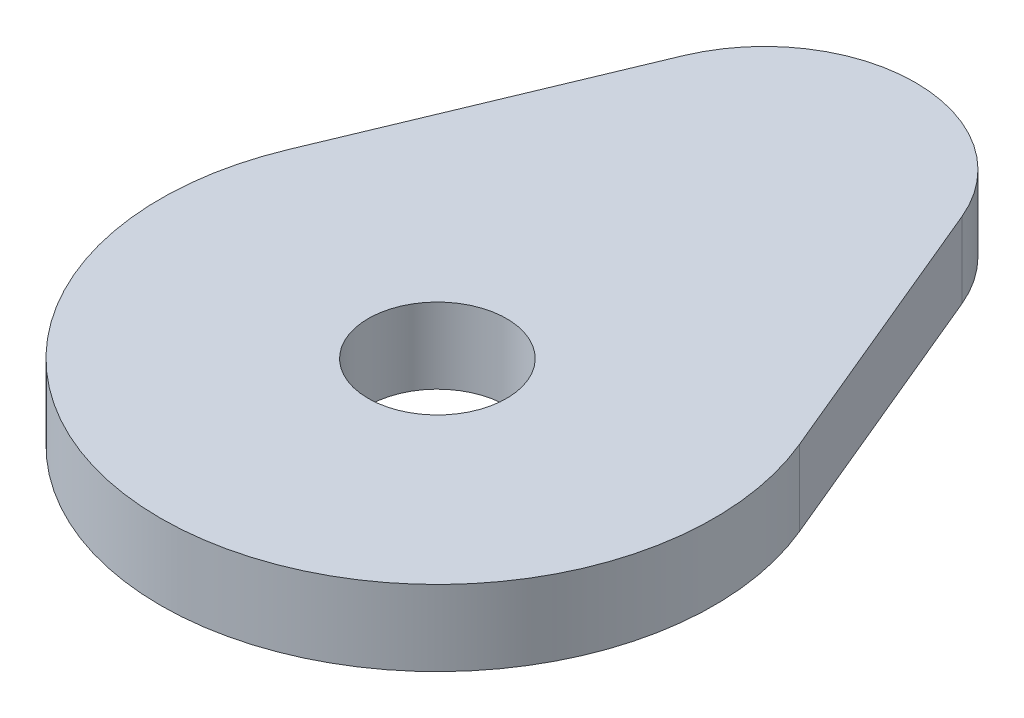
ISO-10303-21;
HEADER;
FILE_DESCRIPTION(('STEP AP214'),'2;1');
FILE_NAME('part.step','',(''),(''),'','','');
FILE_SCHEMA(('AUTOMOTIVE_DESIGN { 1 0 10303 214 1 1 1 1 }'));
ENDSEC;
DATA;
#1=APPLICATION_CONTEXT('core data for automotive mechanical design processes');
#2=APPLICATION_PROTOCOL_DEFINITION('international standard','automotive_design',2000,#1);
#3=PRODUCT_CONTEXT('',#1,'mechanical');
#4=PRODUCT('Part','Part','',(#3));
#5=PRODUCT_RELATED_PRODUCT_CATEGORY('part','',(#4));
#6=PRODUCT_DEFINITION_FORMATION('','',#4);
#7=PRODUCT_DEFINITION_CONTEXT('part definition',#1,'design');
#8=PRODUCT_DEFINITION('design','',#6,#7);
#9=PRODUCT_DEFINITION_SHAPE('','',#8);
#10=(LENGTH_UNIT() NAMED_UNIT(*) SI_UNIT(.MILLI.,.METRE.));
#11=(NAMED_UNIT(*) PLANE_ANGLE_UNIT() SI_UNIT($,.RADIAN.));
#12=(NAMED_UNIT(*) SI_UNIT($,.STERADIAN.) SOLID_ANGLE_UNIT());
#13=UNCERTAINTY_MEASURE_WITH_UNIT(LENGTH_MEASURE(1.E-05),#10,'distance_accuracy_value','');
#14=(GEOMETRIC_REPRESENTATION_CONTEXT(3) GLOBAL_UNCERTAINTY_ASSIGNED_CONTEXT((#13)) GLOBAL_UNIT_ASSIGNED_CONTEXT((#10,
#11,#12)) REPRESENTATION_CONTEXT('',''));
#15=CARTESIAN_POINT('',(0.,0.,0.));
#16=DIRECTION('',(0.,0.,1.));
#17=DIRECTION('',(1.,0.,0.));
#18=AXIS2_PLACEMENT_3D('',#15,#16,#17);
#19=CARTESIAN_POINT('',(0.,3.,-13.));
#20=DIRECTION('',(0.,1.,0.));
#21=DIRECTION('',(0.,0.,1.));
#22=AXIS2_PLACEMENT_3D('',#19,#20,#21);
#23=PLANE('',#22);
#24=CARTESIAN_POINT('',(0.,3.,-13.));
#25=DIRECTION('',(0.,1.,0.));
#26=DIRECTION('',(0.,0.,1.));
#27=AXIS2_PLACEMENT_3D('',#24,#25,#26);
#28=CIRCLE('',#27,6.);
#29=CARTESIAN_POINT('',(5.53846153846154,3.,-15.3076923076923));
#30=VERTEX_POINT('',#29);
#31=CARTESIAN_POINT('',(-5.53846153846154,3.,-15.3076923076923));
#32=VERTEX_POINT('',#31);
#33=EDGE_CURVE('E101',#30,#32,#28,.T.);
#34=ORIENTED_EDGE('',*,*,#33,.T.);
#35=DIRECTION('',(-0.384615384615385,0.,0.923076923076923));
#36=VECTOR('',#35,1.);
#37=CARTESIAN_POINT('',(-5.53846153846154,3.,-15.3076923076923));
#38=LINE('',#37,#36);
#39=CARTESIAN_POINT('',(-10.1538461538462,3.,-4.23076923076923));
#40=VERTEX_POINT('',#39);
#41=EDGE_CURVE('E86',#32,#40,#38,.T.);
#42=ORIENTED_EDGE('',*,*,#41,.T.);
#43=CARTESIAN_POINT('',(0.,3.,0.));
#44=DIRECTION('',(0.,1.,0.));
#45=DIRECTION('',(0.,0.,1.));
#46=AXIS2_PLACEMENT_3D('',#43,#44,#45);
#47=CIRCLE('',#46,11.);
#48=CARTESIAN_POINT('',(10.1538461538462,3.,-4.23076923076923));
#49=VERTEX_POINT('',#48);
#50=EDGE_CURVE('E52',#40,#49,#47,.T.);
#51=ORIENTED_EDGE('',*,*,#50,.T.);
#52=DIRECTION('',(-0.384615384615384,0.,-0.923076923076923));
#53=VECTOR('',#52,1.);
#54=CARTESIAN_POINT('',(5.53846153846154,3.,-15.3076923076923));
#55=LINE('',#54,#53);
#56=EDGE_CURVE('E47',#49,#30,#55,.T.);
#57=ORIENTED_EDGE('',*,*,#56,.T.);
#58=EDGE_LOOP('',(#34,#42,#51,#57));
#59=FACE_BOUND('',#58,.T.);
#60=CARTESIAN_POINT('',(0.,3.,0.));
#61=DIRECTION('',(0.,1.,0.));
#62=DIRECTION('',(0.,0.,1.));
#63=AXIS2_PLACEMENT_3D('',#60,#61,#62);
#64=CIRCLE('',#63,2.75);
#65=CARTESIAN_POINT('',(0.,3.,2.75));
#66=VERTEX_POINT('',#65);
#67=EDGE_CURVE('E91',#66,#66,#64,.T.);
#68=ORIENTED_EDGE('',*,*,#67,.F.);
#69=EDGE_LOOP('',(#68));
#70=FACE_BOUND('',#69,.T.);
#71=ADVANCED_FACE('F32',(#59,#70),#23,.T.);
#72=CARTESIAN_POINT('',(0.,0.,-13.));
#73=DIRECTION('',(0.,1.,0.));
#74=DIRECTION('',(0.,0.,1.));
#75=AXIS2_PLACEMENT_3D('',#72,#73,#74);
#76=PLANE('',#75);
#77=CARTESIAN_POINT('',(0.,0.,-13.));
#78=DIRECTION('',(0.,1.,0.));
#79=DIRECTION('',(0.,0.,1.));
#80=AXIS2_PLACEMENT_3D('',#77,#78,#79);
#81=CIRCLE('',#80,6.);
#82=CARTESIAN_POINT('',(5.53846153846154,0.,-15.3076923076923));
#83=VERTEX_POINT('',#82);
#84=CARTESIAN_POINT('',(-5.53846153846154,0.,-15.3076923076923));
#85=VERTEX_POINT('',#84);
#86=EDGE_CURVE('E78',#83,#85,#81,.T.);
#87=ORIENTED_EDGE('',*,*,#86,.F.);
#88=DIRECTION('',(-0.384615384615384,0.,-0.923076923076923));
#89=VECTOR('',#88,1.);
#90=CARTESIAN_POINT('',(5.53846153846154,0.,-15.3076923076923));
#91=LINE('',#90,#89);
#92=CARTESIAN_POINT('',(10.1538461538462,0.,-4.23076923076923));
#93=VERTEX_POINT('',#92);
#94=EDGE_CURVE('E99',#93,#83,#91,.T.);
#95=ORIENTED_EDGE('',*,*,#94,.F.);
#96=CARTESIAN_POINT('',(0.,0.,0.));
#97=DIRECTION('',(0.,1.,0.));
#98=DIRECTION('',(0.,0.,1.));
#99=AXIS2_PLACEMENT_3D('',#96,#97,#98);
#100=CIRCLE('',#99,11.);
#101=CARTESIAN_POINT('',(-10.1538461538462,0.,-4.23076923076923));
#102=VERTEX_POINT('',#101);
#103=EDGE_CURVE('E79',#102,#93,#100,.T.);
#104=ORIENTED_EDGE('',*,*,#103,.F.);
#105=DIRECTION('',(-0.384615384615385,0.,0.923076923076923));
#106=VECTOR('',#105,1.);
#107=CARTESIAN_POINT('',(-5.53846153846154,0.,-15.3076923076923));
#108=LINE('',#107,#106);
#109=EDGE_CURVE('E73',#85,#102,#108,.T.);
#110=ORIENTED_EDGE('',*,*,#109,.F.);
#111=EDGE_LOOP('',(#87,#95,#104,#110));
#112=FACE_BOUND('',#111,.T.);
#113=CARTESIAN_POINT('',(0.,0.,0.));
#114=DIRECTION('',(0.,1.,0.));
#115=DIRECTION('',(0.,0.,1.));
#116=AXIS2_PLACEMENT_3D('',#113,#114,#115);
#117=CIRCLE('',#116,2.75);
#118=CARTESIAN_POINT('',(0.,0.,2.75));
#119=VERTEX_POINT('',#118);
#120=EDGE_CURVE('E94',#119,#119,#117,.T.);
#121=ORIENTED_EDGE('',*,*,#120,.T.);
#122=EDGE_LOOP('',(#121));
#123=FACE_BOUND('',#122,.T.);
#124=ADVANCED_FACE('F74',(#112,#123),#76,.F.);
#125=CARTESIAN_POINT('',(0.,3.,-13.));
#126=DIRECTION('',(0.,-1.,0.));
#127=DIRECTION('',(0.,0.,-1.));
#128=AXIS2_PLACEMENT_3D('',#125,#126,#127);
#129=CYLINDRICAL_SURFACE('',#128,6.);
#130=ORIENTED_EDGE('',*,*,#86,.T.);
#131=DIRECTION('',(0.,-1.,0.));
#132=VECTOR('',#131,1.);
#133=CARTESIAN_POINT('',(-5.53846153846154,3.,-15.3076923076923));
#134=LINE('',#133,#132);
#135=EDGE_CURVE('E11',#32,#85,#134,.T.);
#136=ORIENTED_EDGE('',*,*,#135,.F.);
#137=ORIENTED_EDGE('',*,*,#33,.F.);
#138=DIRECTION('',(0.,-1.,0.));
#139=VECTOR('',#138,1.);
#140=CARTESIAN_POINT('',(5.53846153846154,3.,-15.3076923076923));
#141=LINE('',#140,#139);
#142=EDGE_CURVE('E90',#30,#83,#141,.T.);
#143=ORIENTED_EDGE('',*,*,#142,.T.);
#144=EDGE_LOOP('',(#130,#136,#137,#143));
#145=FACE_BOUND('',#144,.T.);
#146=ADVANCED_FACE('F34',(#145),#129,.T.);
#147=CARTESIAN_POINT('',(-5.53846153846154,3.,-15.3076923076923));
#148=DIRECTION('',(0.923076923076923,0.,0.384615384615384));
#149=DIRECTION('',(0.384615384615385,0.,-0.923076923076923));
#150=AXIS2_PLACEMENT_3D('',#147,#148,#149);
#151=PLANE('',#150);
#152=ORIENTED_EDGE('',*,*,#109,.T.);
#153=DIRECTION('',(0.,-1.,0.));
#154=VECTOR('',#153,1.);
#155=CARTESIAN_POINT('',(-10.1538461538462,3.,-4.23076923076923));
#156=LINE('',#155,#154);
#157=EDGE_CURVE('E40',#40,#102,#156,.T.);
#158=ORIENTED_EDGE('',*,*,#157,.F.);
#159=ORIENTED_EDGE('',*,*,#41,.F.);
#160=ORIENTED_EDGE('',*,*,#135,.T.);
#161=EDGE_LOOP('',(#152,#158,#159,#160));
#162=FACE_BOUND('',#161,.T.);
#163=ADVANCED_FACE('F85',(#162),#151,.F.);
#164=CARTESIAN_POINT('',(0.,3.,0.));
#165=DIRECTION('',(0.,-1.,0.));
#166=DIRECTION('',(0.,0.,-1.));
#167=AXIS2_PLACEMENT_3D('',#164,#165,#166);
#168=CYLINDRICAL_SURFACE('',#167,11.);
#169=ORIENTED_EDGE('',*,*,#103,.T.);
#170=DIRECTION('',(0.,-1.,0.));
#171=VECTOR('',#170,1.);
#172=CARTESIAN_POINT('',(10.1538461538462,3.,-4.23076923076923));
#173=LINE('',#172,#171);
#174=EDGE_CURVE('E107',#49,#93,#173,.T.);
#175=ORIENTED_EDGE('',*,*,#174,.F.);
#176=ORIENTED_EDGE('',*,*,#50,.F.);
#177=ORIENTED_EDGE('',*,*,#157,.T.);
#178=EDGE_LOOP('',(#169,#175,#176,#177));
#179=FACE_BOUND('',#178,.T.);
#180=ADVANCED_FACE('F110',(#179),#168,.T.);
#181=CARTESIAN_POINT('',(5.53846153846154,3.,-15.3076923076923));
#182=DIRECTION('',(-0.923076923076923,0.,0.384615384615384));
#183=DIRECTION('',(0.384615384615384,0.,0.923076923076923));
#184=AXIS2_PLACEMENT_3D('',#181,#182,#183);
#185=PLANE('',#184);
#186=ORIENTED_EDGE('',*,*,#94,.T.);
#187=ORIENTED_EDGE('',*,*,#142,.F.);
#188=ORIENTED_EDGE('',*,*,#56,.F.);
#189=ORIENTED_EDGE('',*,*,#174,.T.);
#190=EDGE_LOOP('',(#186,#187,#188,#189));
#191=FACE_BOUND('',#190,.T.);
#192=ADVANCED_FACE('F112',(#191),#185,.F.);
#193=CARTESIAN_POINT('',(0.,3.,0.));
#194=DIRECTION('',(0.,-1.,0.));
#195=DIRECTION('',(0.,0.,-1.));
#196=AXIS2_PLACEMENT_3D('',#193,#194,#195);
#197=CYLINDRICAL_SURFACE('',#196,2.75);
#198=ORIENTED_EDGE('',*,*,#67,.T.);
#199=EDGE_LOOP('',(#198));
#200=FACE_BOUND('',#199,.T.);
#201=ORIENTED_EDGE('',*,*,#120,.F.);
#202=EDGE_LOOP('',(#201));
#203=FACE_BOUND('',#202,.T.);
#204=ADVANCED_FACE('F118',(#200,#203),#197,.F.);
#205=CLOSED_SHELL('',(#71,#124,#146,#163,#180,#192,#204));
#206=MANIFOLD_SOLID_BREP('B2',#205);
#207=ADVANCED_BREP_SHAPE_REPRESENTATION('',(#18,#206),#14);
#208=SHAPE_DEFINITION_REPRESENTATION(#9,#207);
ENDSEC;
END-ISO-10303-21;
